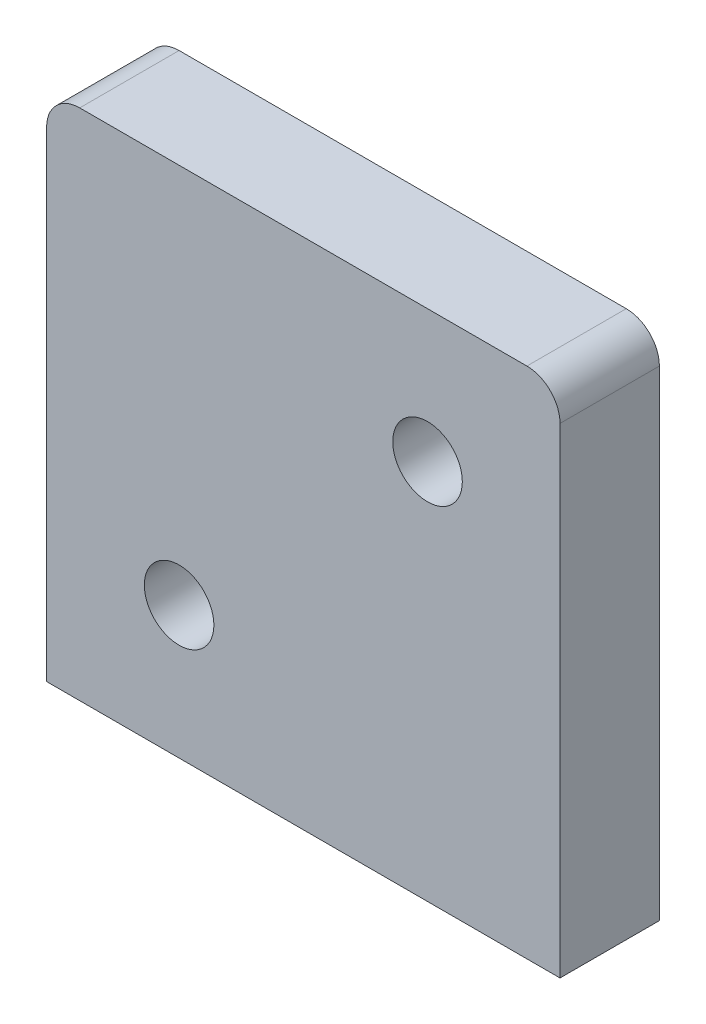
from build123d import *

# Parameters (mm, degrees)
SKETCH_1_R      = 2.1
EXTRUDE_1_DEPTH = 6


with BuildPart() as part:
    # Sketch 1 → Extrude 1 (new body)
    with BuildSketch(Plane.XY):
        with BuildLine():
            Line((0, 0), (31, 0))
            Line((31, 0), (31, 29))
            ThreePointArc((31, 29), (30.414213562, 30.414213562), (29, 31))
            Line((29, 31), (2, 31))
            ThreePointArc((2, 31), (0.585786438, 30.414213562), (0, 29))
            Line((0, 29), (0, 0))
        make_face()
        with Locations((23, 23)):
            Circle(SKETCH_1_R, mode=Mode.SUBTRACT)
        with Locations((8, 8)):
            Circle(SKETCH_1_R, mode=Mode.SUBTRACT)
    extrude(amount=EXTRUDE_1_DEPTH)


solid = part.part
